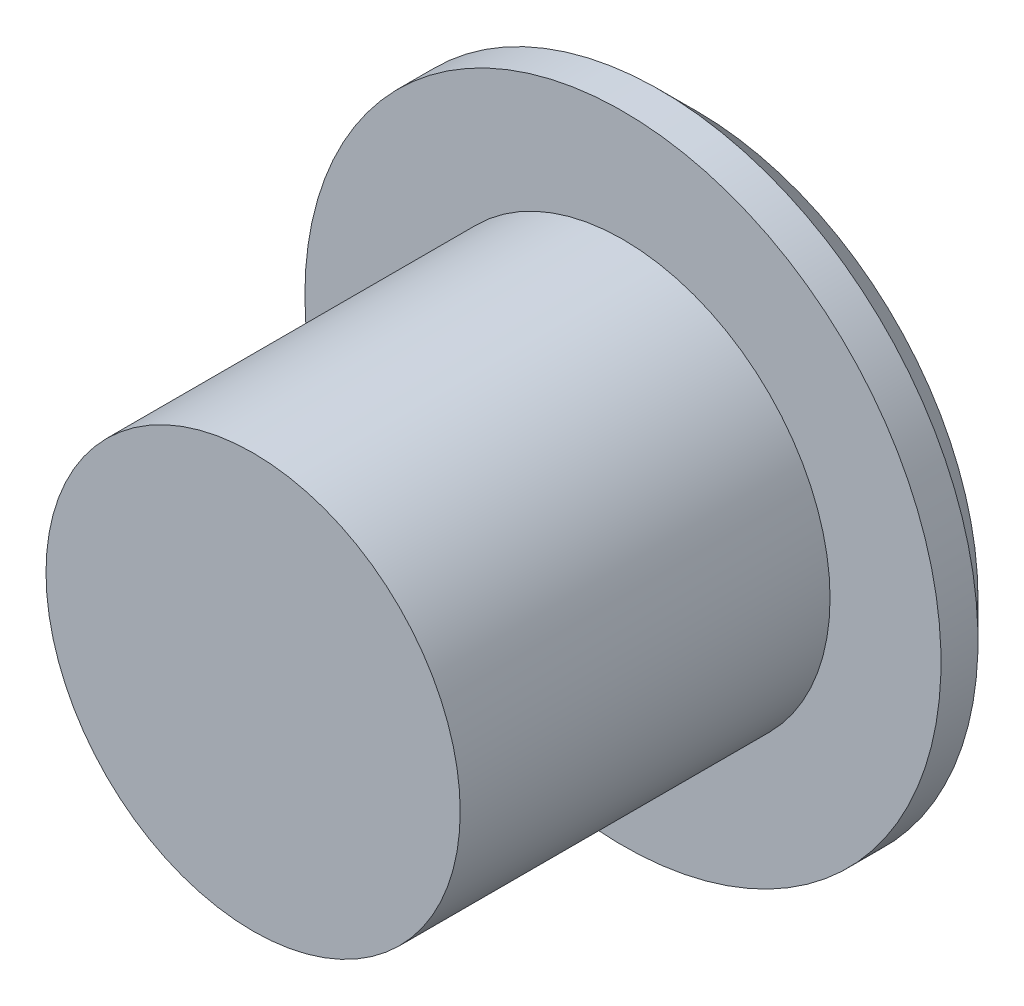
from build123d import *

# Parameters (mm, degrees)
ESQUISSE1_R        = 2.8
BOSS_EXTRU_2_DEPTH = 5
ESQUISSE2_R        = 4.3
BOSS_EXTRU_3_DEPTH = 1
CHANFREIN1_SIZE    = 0.5


with BuildPart() as part:
    # Esquisse1 → Boss.-Extru.2 (new body)
    with BuildSketch(Plane.XY):
        Circle(ESQUISSE1_R)
    extrude(amount=BOSS_EXTRU_2_DEPTH)

    # Esquisse2 → Boss.-Extru.3 (add)
    with BuildSketch(Plane(origin=(0, 0, 0), x_dir=(-1, 0, 0), z_dir=(0, 0, -1))):
        Circle(ESQUISSE2_R)
    extrude(amount=BOSS_EXTRU_3_DEPTH)

    # Chanfrein1
    chanfrein1_edges = [part.edges().sort_by_distance(p)[0] for p in [
        (4.3, 0, -1),
    ]]
    chamfer(chanfrein1_edges, length=CHANFREIN1_SIZE)


solid = part.part
